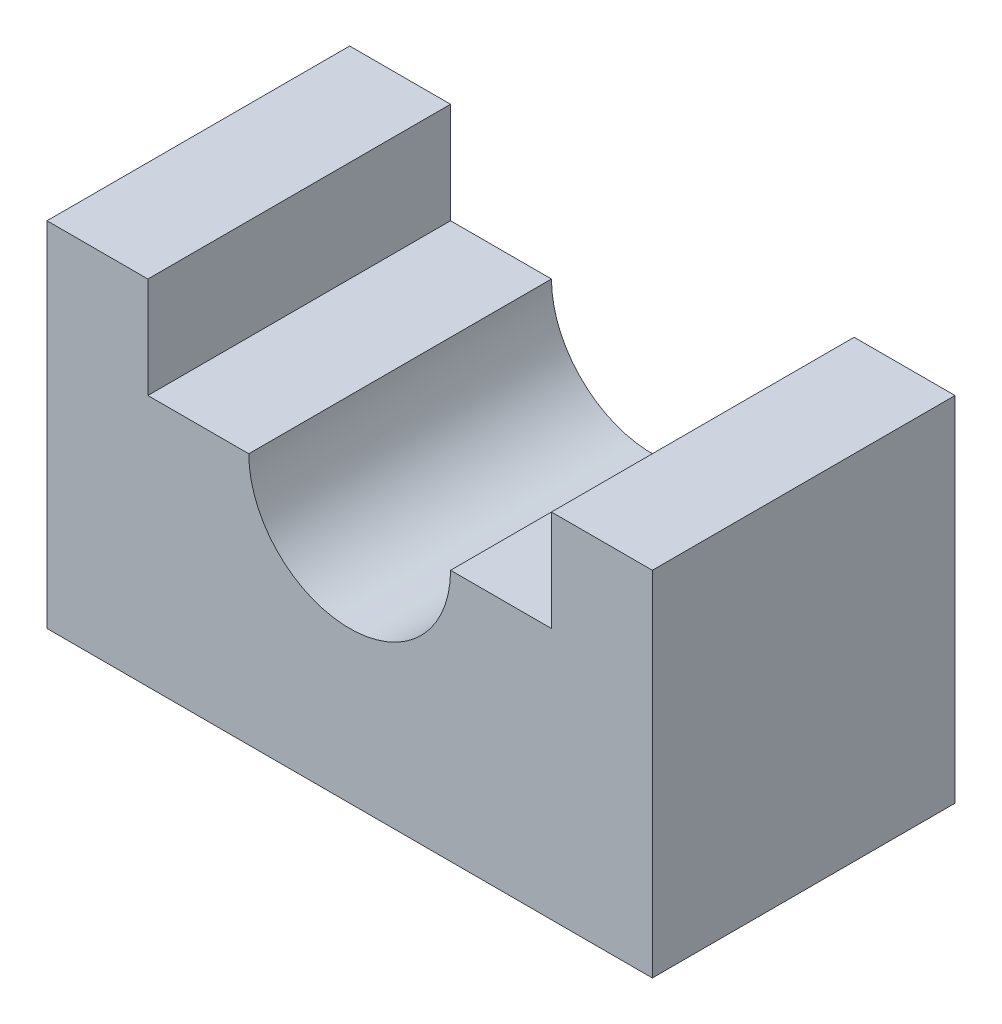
ISO-10303-21;
HEADER;
FILE_DESCRIPTION(('STEP AP214'),'2;1');
FILE_NAME('part.step','',(''),(''),'','','');
FILE_SCHEMA(('AUTOMOTIVE_DESIGN { 1 0 10303 214 1 1 1 1 }'));
ENDSEC;
DATA;
#1=APPLICATION_CONTEXT('core data for automotive mechanical design processes');
#2=APPLICATION_PROTOCOL_DEFINITION('international standard','automotive_design',2000,#1);
#3=PRODUCT_CONTEXT('',#1,'mechanical');
#4=PRODUCT('Part','Part','',(#3));
#5=PRODUCT_RELATED_PRODUCT_CATEGORY('part','',(#4));
#6=PRODUCT_DEFINITION_FORMATION('','',#4);
#7=PRODUCT_DEFINITION_CONTEXT('part definition',#1,'design');
#8=PRODUCT_DEFINITION('design','',#6,#7);
#9=PRODUCT_DEFINITION_SHAPE('','',#8);
#10=(LENGTH_UNIT() NAMED_UNIT(*) SI_UNIT(.MILLI.,.METRE.));
#11=(NAMED_UNIT(*) PLANE_ANGLE_UNIT() SI_UNIT($,.RADIAN.));
#12=(NAMED_UNIT(*) SI_UNIT($,.STERADIAN.) SOLID_ANGLE_UNIT());
#13=UNCERTAINTY_MEASURE_WITH_UNIT(LENGTH_MEASURE(1.E-05),#10,'distance_accuracy_value','');
#14=(GEOMETRIC_REPRESENTATION_CONTEXT(3) GLOBAL_UNCERTAINTY_ASSIGNED_CONTEXT((#13)) GLOBAL_UNIT_ASSIGNED_CONTEXT((#10,
#11,#12)) REPRESENTATION_CONTEXT('',''));
#15=CARTESIAN_POINT('',(0.,0.,0.));
#16=DIRECTION('',(0.,0.,1.));
#17=DIRECTION('',(1.,0.,0.));
#18=AXIS2_PLACEMENT_3D('',#15,#16,#17);
#19=CARTESIAN_POINT('',(30.,35.,15.));
#20=DIRECTION('',(1.,0.,0.));
#21=DIRECTION('',(0.,1.,0.));
#22=AXIS2_PLACEMENT_3D('',#19,#20,#21);
#23=PLANE('',#22);
#24=DIRECTION('',(0.,-1.,0.));
#25=VECTOR('',#24,1.);
#26=CARTESIAN_POINT('',(30.,35.,-15.));
#27=LINE('',#26,#25);
#28=CARTESIAN_POINT('',(30.,35.,-15.));
#29=VERTEX_POINT('',#28);
#30=CARTESIAN_POINT('',(30.,0.,-15.));
#31=VERTEX_POINT('',#30);
#32=EDGE_CURVE('E140',#29,#31,#27,.T.);
#33=ORIENTED_EDGE('',*,*,#32,.T.);
#34=DIRECTION('',(0.,0.,-1.));
#35=VECTOR('',#34,1.);
#36=CARTESIAN_POINT('',(30.,0.,15.));
#37=LINE('',#36,#35);
#38=CARTESIAN_POINT('',(30.,0.,15.));
#39=VERTEX_POINT('',#38);
#40=EDGE_CURVE('E11',#39,#31,#37,.T.);
#41=ORIENTED_EDGE('',*,*,#40,.F.);
#42=DIRECTION('',(0.,-1.,0.));
#43=VECTOR('',#42,1.);
#44=CARTESIAN_POINT('',(30.,35.,15.));
#45=LINE('',#44,#43);
#46=CARTESIAN_POINT('',(30.,35.,15.));
#47=VERTEX_POINT('',#46);
#48=EDGE_CURVE('E158',#47,#39,#45,.T.);
#49=ORIENTED_EDGE('',*,*,#48,.F.);
#50=DIRECTION('',(0.,0.,-1.));
#51=VECTOR('',#50,1.);
#52=CARTESIAN_POINT('',(30.,35.,15.));
#53=LINE('',#52,#51);
#54=EDGE_CURVE('E136',#47,#29,#53,.T.);
#55=ORIENTED_EDGE('',*,*,#54,.T.);
#56=EDGE_LOOP('',(#33,#41,#49,#55));
#57=FACE_BOUND('',#56,.T.);
#58=ADVANCED_FACE('F32',(#57),#23,.F.);
#59=CARTESIAN_POINT('',(30.,0.,15.));
#60=DIRECTION('',(0.,1.,0.));
#61=DIRECTION('',(0.,0.,1.));
#62=AXIS2_PLACEMENT_3D('',#59,#60,#61);
#63=PLANE('',#62);
#64=DIRECTION('',(1.,0.,0.));
#65=VECTOR('',#64,1.);
#66=CARTESIAN_POINT('',(30.,0.,-15.));
#67=LINE('',#66,#65);
#68=CARTESIAN_POINT('',(90.,0.,-15.));
#69=VERTEX_POINT('',#68);
#70=EDGE_CURVE('E143',#31,#69,#67,.T.);
#71=ORIENTED_EDGE('',*,*,#70,.T.);
#72=DIRECTION('',(0.,0.,-1.));
#73=VECTOR('',#72,1.);
#74=CARTESIAN_POINT('',(90.,0.,15.));
#75=LINE('',#74,#73);
#76=CARTESIAN_POINT('',(90.,0.,15.));
#77=VERTEX_POINT('',#76);
#78=EDGE_CURVE('E40',#77,#69,#75,.T.);
#79=ORIENTED_EDGE('',*,*,#78,.F.);
#80=DIRECTION('',(1.,0.,0.));
#81=VECTOR('',#80,1.);
#82=CARTESIAN_POINT('',(30.,0.,15.));
#83=LINE('',#82,#81);
#84=EDGE_CURVE('E97',#39,#77,#83,.T.);
#85=ORIENTED_EDGE('',*,*,#84,.F.);
#86=ORIENTED_EDGE('',*,*,#40,.T.);
#87=EDGE_LOOP('',(#71,#79,#85,#86));
#88=FACE_BOUND('',#87,.T.);
#89=ADVANCED_FACE('F207',(#88),#63,.F.);
#90=CARTESIAN_POINT('',(90.,0.,15.));
#91=DIRECTION('',(-1.,0.,0.));
#92=DIRECTION('',(0.,0.,1.));
#93=AXIS2_PLACEMENT_3D('',#90,#91,#92);
#94=PLANE('',#93);
#95=DIRECTION('',(0.,1.,0.));
#96=VECTOR('',#95,1.);
#97=CARTESIAN_POINT('',(90.,0.,-15.));
#98=LINE('',#97,#96);
#99=CARTESIAN_POINT('',(90.,35.,-15.));
#100=VERTEX_POINT('',#99);
#101=EDGE_CURVE('E145',#69,#100,#98,.T.);
#102=ORIENTED_EDGE('',*,*,#101,.T.);
#103=DIRECTION('',(0.,0.,-1.));
#104=VECTOR('',#103,1.);
#105=CARTESIAN_POINT('',(90.,35.,15.));
#106=LINE('',#105,#104);
#107=CARTESIAN_POINT('',(90.,35.,15.));
#108=VERTEX_POINT('',#107);
#109=EDGE_CURVE('E171',#108,#100,#106,.T.);
#110=ORIENTED_EDGE('',*,*,#109,.F.);
#111=DIRECTION('',(0.,1.,0.));
#112=VECTOR('',#111,1.);
#113=CARTESIAN_POINT('',(90.,0.,15.));
#114=LINE('',#113,#112);
#115=EDGE_CURVE('E179',#77,#108,#114,.T.);
#116=ORIENTED_EDGE('',*,*,#115,.F.);
#117=ORIENTED_EDGE('',*,*,#78,.T.);
#118=EDGE_LOOP('',(#102,#110,#116,#117));
#119=FACE_BOUND('',#118,.T.);
#120=ADVANCED_FACE('F177',(#119),#94,.F.);
#121=CARTESIAN_POINT('',(90.,35.,15.));
#122=DIRECTION('',(0.,-1.,0.));
#123=DIRECTION('',(0.,0.,-1.));
#124=AXIS2_PLACEMENT_3D('',#121,#122,#123);
#125=PLANE('',#124);
#126=DIRECTION('',(-1.,0.,0.));
#127=VECTOR('',#126,1.);
#128=CARTESIAN_POINT('',(90.,35.,-15.));
#129=LINE('',#128,#127);
#130=CARTESIAN_POINT('',(80.,35.,-15.));
#131=VERTEX_POINT('',#130);
#132=EDGE_CURVE('E147',#100,#131,#129,.T.);
#133=ORIENTED_EDGE('',*,*,#132,.T.);
#134=DIRECTION('',(0.,0.,-1.));
#135=VECTOR('',#134,1.);
#136=CARTESIAN_POINT('',(80.,35.,15.));
#137=LINE('',#136,#135);
#138=CARTESIAN_POINT('',(80.,35.,15.));
#139=VERTEX_POINT('',#138);
#140=EDGE_CURVE('E168',#139,#131,#137,.T.);
#141=ORIENTED_EDGE('',*,*,#140,.F.);
#142=DIRECTION('',(-1.,0.,0.));
#143=VECTOR('',#142,1.);
#144=CARTESIAN_POINT('',(90.,35.,15.));
#145=LINE('',#144,#143);
#146=EDGE_CURVE('E197',#108,#139,#145,.T.);
#147=ORIENTED_EDGE('',*,*,#146,.F.);
#148=ORIENTED_EDGE('',*,*,#109,.T.);
#149=EDGE_LOOP('',(#133,#141,#147,#148));
#150=FACE_BOUND('',#149,.T.);
#151=ADVANCED_FACE('F188',(#150),#125,.F.);
#152=CARTESIAN_POINT('',(80.,35.,15.));
#153=DIRECTION('',(1.,0.,0.));
#154=DIRECTION('',(0.,0.,-1.));
#155=AXIS2_PLACEMENT_3D('',#152,#153,#154);
#156=PLANE('',#155);
#157=DIRECTION('',(0.,-1.,0.));
#158=VECTOR('',#157,1.);
#159=CARTESIAN_POINT('',(80.,35.,-15.));
#160=LINE('',#159,#158);
#161=CARTESIAN_POINT('',(80.,25.,-15.));
#162=VERTEX_POINT('',#161);
#163=EDGE_CURVE('E149',#131,#162,#160,.T.);
#164=ORIENTED_EDGE('',*,*,#163,.T.);
#165=DIRECTION('',(0.,0.,-1.));
#166=VECTOR('',#165,1.);
#167=CARTESIAN_POINT('',(80.,25.,15.));
#168=LINE('',#167,#166);
#169=CARTESIAN_POINT('',(80.,25.,15.));
#170=VERTEX_POINT('',#169);
#171=EDGE_CURVE('E165',#170,#162,#168,.T.);
#172=ORIENTED_EDGE('',*,*,#171,.F.);
#173=DIRECTION('',(0.,-1.,0.));
#174=VECTOR('',#173,1.);
#175=CARTESIAN_POINT('',(80.,35.,15.));
#176=LINE('',#175,#174);
#177=EDGE_CURVE('E194',#139,#170,#176,.T.);
#178=ORIENTED_EDGE('',*,*,#177,.F.);
#179=ORIENTED_EDGE('',*,*,#140,.T.);
#180=EDGE_LOOP('',(#164,#172,#178,#179));
#181=FACE_BOUND('',#180,.T.);
#182=ADVANCED_FACE('F192',(#181),#156,.F.);
#183=CARTESIAN_POINT('',(80.,25.,15.));
#184=DIRECTION('',(0.,-1.,0.));
#185=DIRECTION('',(0.,0.,-1.));
#186=AXIS2_PLACEMENT_3D('',#183,#184,#185);
#187=PLANE('',#186);
#188=DIRECTION('',(-1.,0.,0.));
#189=VECTOR('',#188,1.);
#190=CARTESIAN_POINT('',(80.,25.,-15.));
#191=LINE('',#190,#189);
#192=CARTESIAN_POINT('',(70.,25.,-15.));
#193=VERTEX_POINT('',#192);
#194=EDGE_CURVE('E151',#162,#193,#191,.T.);
#195=ORIENTED_EDGE('',*,*,#194,.T.);
#196=DIRECTION('',(0.,0.,-1.));
#197=VECTOR('',#196,1.);
#198=CARTESIAN_POINT('',(70.,25.,15.));
#199=LINE('',#198,#197);
#200=CARTESIAN_POINT('',(70.,25.,15.));
#201=VERTEX_POINT('',#200);
#202=EDGE_CURVE('E162',#201,#193,#199,.T.);
#203=ORIENTED_EDGE('',*,*,#202,.F.);
#204=DIRECTION('',(-1.,0.,0.));
#205=VECTOR('',#204,1.);
#206=CARTESIAN_POINT('',(80.,25.,15.));
#207=LINE('',#206,#205);
#208=EDGE_CURVE('E196',#170,#201,#207,.T.);
#209=ORIENTED_EDGE('',*,*,#208,.F.);
#210=ORIENTED_EDGE('',*,*,#171,.T.);
#211=EDGE_LOOP('',(#195,#203,#209,#210));
#212=FACE_BOUND('',#211,.T.);
#213=ADVANCED_FACE('F219',(#212),#187,.F.);
#214=CARTESIAN_POINT('',(60.,25.,15.));
#215=DIRECTION('',(0.,0.,-1.));
#216=DIRECTION('',(-1.,0.,0.));
#217=AXIS2_PLACEMENT_3D('',#214,#215,#216);
#218=CYLINDRICAL_SURFACE('',#217,10.);
#219=CARTESIAN_POINT('',(60.,25.,-15.));
#220=DIRECTION('',(0.,0.,-1.));
#221=DIRECTION('',(-1.,0.,0.));
#222=AXIS2_PLACEMENT_3D('',#219,#220,#221);
#223=CIRCLE('',#222,10.);
#224=CARTESIAN_POINT('',(50.,25.,-15.));
#225=VERTEX_POINT('',#224);
#226=EDGE_CURVE('E153',#193,#225,#223,.T.);
#227=ORIENTED_EDGE('',*,*,#226,.T.);
#228=DIRECTION('',(0.,0.,-1.));
#229=VECTOR('',#228,1.);
#230=CARTESIAN_POINT('',(50.,25.,15.));
#231=LINE('',#230,#229);
#232=CARTESIAN_POINT('',(50.,25.,15.));
#233=VERTEX_POINT('',#232);
#234=EDGE_CURVE('E131',#233,#225,#231,.T.);
#235=ORIENTED_EDGE('',*,*,#234,.F.);
#236=CARTESIAN_POINT('',(60.,25.,15.));
#237=DIRECTION('',(0.,0.,-1.));
#238=DIRECTION('',(-1.,0.,0.));
#239=AXIS2_PLACEMENT_3D('',#236,#237,#238);
#240=CIRCLE('',#239,10.);
#241=EDGE_CURVE('E122',#201,#233,#240,.T.);
#242=ORIENTED_EDGE('',*,*,#241,.F.);
#243=ORIENTED_EDGE('',*,*,#202,.T.);
#244=EDGE_LOOP('',(#227,#235,#242,#243));
#245=FACE_BOUND('',#244,.T.);
#246=ADVANCED_FACE('F222',(#245),#218,.F.);
#247=CARTESIAN_POINT('',(50.,25.,15.));
#248=DIRECTION('',(0.,-1.,0.));
#249=DIRECTION('',(0.,0.,-1.));
#250=AXIS2_PLACEMENT_3D('',#247,#248,#249);
#251=PLANE('',#250);
#252=DIRECTION('',(-1.,0.,0.));
#253=VECTOR('',#252,1.);
#254=CARTESIAN_POINT('',(50.,25.,-15.));
#255=LINE('',#254,#253);
#256=CARTESIAN_POINT('',(40.,25.,-15.));
#257=VERTEX_POINT('',#256);
#258=EDGE_CURVE('E130',#225,#257,#255,.T.);
#259=ORIENTED_EDGE('',*,*,#258,.T.);
#260=DIRECTION('',(0.,0.,-1.));
#261=VECTOR('',#260,1.);
#262=CARTESIAN_POINT('',(40.,25.,15.));
#263=LINE('',#262,#261);
#264=CARTESIAN_POINT('',(40.,25.,15.));
#265=VERTEX_POINT('',#264);
#266=EDGE_CURVE('E127',#265,#257,#263,.T.);
#267=ORIENTED_EDGE('',*,*,#266,.F.);
#268=DIRECTION('',(-1.,0.,0.));
#269=VECTOR('',#268,1.);
#270=CARTESIAN_POINT('',(50.,25.,15.));
#271=LINE('',#270,#269);
#272=EDGE_CURVE('E116',#233,#265,#271,.T.);
#273=ORIENTED_EDGE('',*,*,#272,.F.);
#274=ORIENTED_EDGE('',*,*,#234,.T.);
#275=EDGE_LOOP('',(#259,#267,#273,#274));
#276=FACE_BOUND('',#275,.T.);
#277=ADVANCED_FACE('F128',(#276),#251,.F.);
#278=CARTESIAN_POINT('',(40.,25.,15.));
#279=DIRECTION('',(-1.,0.,0.));
#280=DIRECTION('',(0.,-1.,0.));
#281=AXIS2_PLACEMENT_3D('',#278,#279,#280);
#282=PLANE('',#281);
#283=DIRECTION('',(0.,1.,0.));
#284=VECTOR('',#283,1.);
#285=CARTESIAN_POINT('',(40.,25.,-15.));
#286=LINE('',#285,#284);
#287=CARTESIAN_POINT('',(40.,35.,-15.));
#288=VERTEX_POINT('',#287);
#289=EDGE_CURVE('E83',#257,#288,#286,.T.);
#290=ORIENTED_EDGE('',*,*,#289,.T.);
#291=DIRECTION('',(0.,0.,-1.));
#292=VECTOR('',#291,1.);
#293=CARTESIAN_POINT('',(40.,35.,15.));
#294=LINE('',#293,#292);
#295=CARTESIAN_POINT('',(40.,35.,15.));
#296=VERTEX_POINT('',#295);
#297=EDGE_CURVE('E132',#296,#288,#294,.T.);
#298=ORIENTED_EDGE('',*,*,#297,.F.);
#299=DIRECTION('',(0.,1.,0.));
#300=VECTOR('',#299,1.);
#301=CARTESIAN_POINT('',(40.,25.,15.));
#302=LINE('',#301,#300);
#303=EDGE_CURVE('E120',#265,#296,#302,.T.);
#304=ORIENTED_EDGE('',*,*,#303,.F.);
#305=ORIENTED_EDGE('',*,*,#266,.T.);
#306=EDGE_LOOP('',(#290,#298,#304,#305));
#307=FACE_BOUND('',#306,.T.);
#308=ADVANCED_FACE('F134',(#307),#282,.F.);
#309=CARTESIAN_POINT('',(40.,35.,15.));
#310=DIRECTION('',(0.,-1.,0.));
#311=DIRECTION('',(0.,0.,-1.));
#312=AXIS2_PLACEMENT_3D('',#309,#310,#311);
#313=PLANE('',#312);
#314=DIRECTION('',(-1.,0.,0.));
#315=VECTOR('',#314,1.);
#316=CARTESIAN_POINT('',(40.,35.,-15.));
#317=LINE('',#316,#315);
#318=EDGE_CURVE('E89',#288,#29,#317,.T.);
#319=ORIENTED_EDGE('',*,*,#318,.T.);
#320=ORIENTED_EDGE('',*,*,#54,.F.);
#321=DIRECTION('',(-1.,0.,0.));
#322=VECTOR('',#321,1.);
#323=CARTESIAN_POINT('',(40.,35.,15.));
#324=LINE('',#323,#322);
#325=EDGE_CURVE('E48',#296,#47,#324,.T.);
#326=ORIENTED_EDGE('',*,*,#325,.F.);
#327=ORIENTED_EDGE('',*,*,#297,.T.);
#328=EDGE_LOOP('',(#319,#320,#326,#327));
#329=FACE_BOUND('',#328,.T.);
#330=ADVANCED_FACE('F231',(#329),#313,.F.);
#331=CARTESIAN_POINT('',(60.,25.,15.));
#332=DIRECTION('',(0.,0.,-1.));
#333=DIRECTION('',(-1.,0.,0.));
#334=AXIS2_PLACEMENT_3D('',#331,#332,#333);
#335=PLANE('',#334);
#336=ORIENTED_EDGE('',*,*,#48,.T.);
#337=ORIENTED_EDGE('',*,*,#84,.T.);
#338=ORIENTED_EDGE('',*,*,#115,.T.);
#339=ORIENTED_EDGE('',*,*,#146,.T.);
#340=ORIENTED_EDGE('',*,*,#177,.T.);
#341=ORIENTED_EDGE('',*,*,#208,.T.);
#342=ORIENTED_EDGE('',*,*,#241,.T.);
#343=ORIENTED_EDGE('',*,*,#272,.T.);
#344=ORIENTED_EDGE('',*,*,#303,.T.);
#345=ORIENTED_EDGE('',*,*,#325,.T.);
#346=EDGE_LOOP('',(#336,#337,#338,#339,#340,#341,#342,#343,#344,#345));
#347=FACE_BOUND('',#346,.T.);
#348=ADVANCED_FACE('F118',(#347),#335,.F.);
#349=CARTESIAN_POINT('',(60.,25.,-15.));
#350=DIRECTION('',(0.,0.,-1.));
#351=DIRECTION('',(-1.,0.,0.));
#352=AXIS2_PLACEMENT_3D('',#349,#350,#351);
#353=PLANE('',#352);
#354=ORIENTED_EDGE('',*,*,#32,.F.);
#355=ORIENTED_EDGE('',*,*,#318,.F.);
#356=ORIENTED_EDGE('',*,*,#289,.F.);
#357=ORIENTED_EDGE('',*,*,#258,.F.);
#358=ORIENTED_EDGE('',*,*,#226,.F.);
#359=ORIENTED_EDGE('',*,*,#194,.F.);
#360=ORIENTED_EDGE('',*,*,#163,.F.);
#361=ORIENTED_EDGE('',*,*,#132,.F.);
#362=ORIENTED_EDGE('',*,*,#101,.F.);
#363=ORIENTED_EDGE('',*,*,#70,.F.);
#364=EDGE_LOOP('',(#354,#355,#356,#357,#358,#359,#360,#361,#362,#363));
#365=FACE_BOUND('',#364,.T.);
#366=ADVANCED_FACE('F183',(#365),#353,.T.);
#367=CLOSED_SHELL('',(#58,#89,#120,#151,#182,#213,#246,#277,#308,#330,#348,#366));
#368=MANIFOLD_SOLID_BREP('B2',#367);
#369=ADVANCED_BREP_SHAPE_REPRESENTATION('',(#18,#368),#14);
#370=SHAPE_DEFINITION_REPRESENTATION(#9,#369);
ENDSEC;
END-ISO-10303-21;
